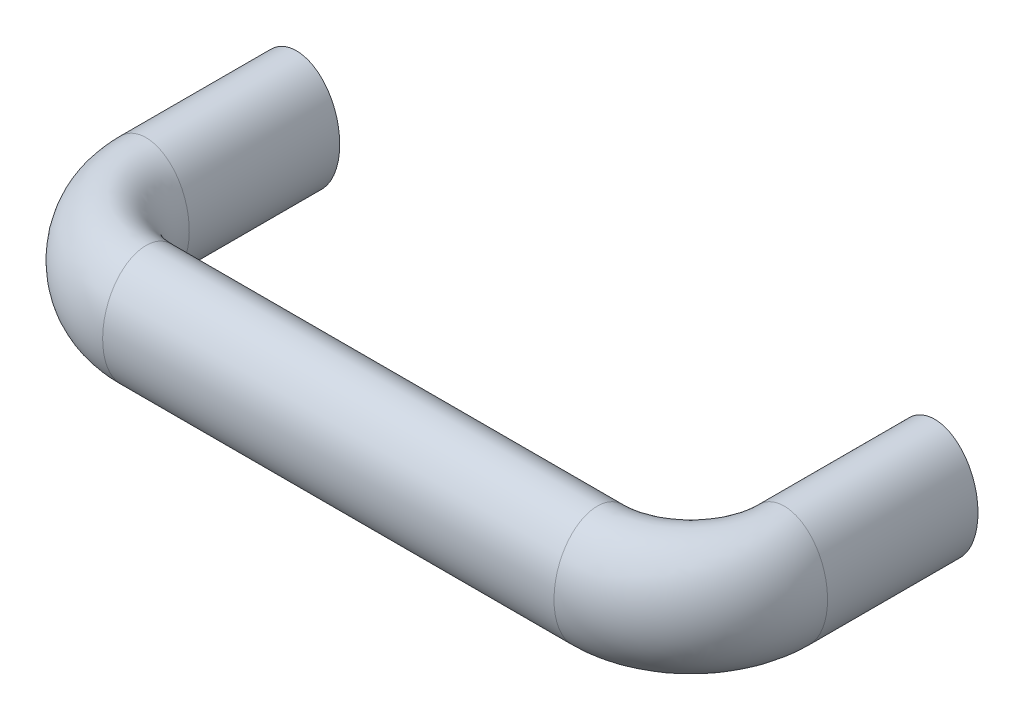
ISO-10303-21;
HEADER;
FILE_DESCRIPTION(('STEP AP214'),'2;1');
FILE_NAME('part.step','',(''),(''),'','','');
FILE_SCHEMA(('AUTOMOTIVE_DESIGN { 1 0 10303 214 1 1 1 1 }'));
ENDSEC;
DATA;
#1=APPLICATION_CONTEXT('core data for automotive mechanical design processes');
#2=APPLICATION_PROTOCOL_DEFINITION('international standard','automotive_design',2000,#1);
#3=PRODUCT_CONTEXT('',#1,'mechanical');
#4=PRODUCT('Part','Part','',(#3));
#5=PRODUCT_RELATED_PRODUCT_CATEGORY('part','',(#4));
#6=PRODUCT_DEFINITION_FORMATION('','',#4);
#7=PRODUCT_DEFINITION_CONTEXT('part definition',#1,'design');
#8=PRODUCT_DEFINITION('design','',#6,#7);
#9=PRODUCT_DEFINITION_SHAPE('','',#8);
#10=(LENGTH_UNIT() NAMED_UNIT(*) SI_UNIT(.MILLI.,.METRE.));
#11=(NAMED_UNIT(*) PLANE_ANGLE_UNIT() SI_UNIT($,.RADIAN.));
#12=(NAMED_UNIT(*) SI_UNIT($,.STERADIAN.) SOLID_ANGLE_UNIT());
#13=UNCERTAINTY_MEASURE_WITH_UNIT(LENGTH_MEASURE(1.E-05),#10,'distance_accuracy_value','');
#14=(GEOMETRIC_REPRESENTATION_CONTEXT(3) GLOBAL_UNCERTAINTY_ASSIGNED_CONTEXT((#13)) GLOBAL_UNIT_ASSIGNED_CONTEXT((#10,
#11,#12)) REPRESENTATION_CONTEXT('',''));
#15=CARTESIAN_POINT('',(0.,0.,0.));
#16=DIRECTION('',(0.,0.,1.));
#17=DIRECTION('',(1.,0.,0.));
#18=AXIS2_PLACEMENT_3D('',#15,#16,#17);
#19=CARTESIAN_POINT('',(0.,0.,0.));
#20=DIRECTION('',(0.,0.,-1.));
#21=DIRECTION('',(0.,1.,0.));
#22=AXIS2_PLACEMENT_3D('',#19,#20,#21);
#23=CONICAL_SURFACE('',#22,3.24999999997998,0.785398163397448);
#24=CARTESIAN_POINT('',(0.,0.,0.249999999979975));
#25=DIRECTION('',(0.,0.,-1.));
#26=DIRECTION('',(0.,1.,0.));
#27=AXIS2_PLACEMENT_3D('',#24,#25,#26);
#28=CIRCLE('',#27,3.);
#29=CARTESIAN_POINT('',(0.,3.,0.249999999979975));
#30=VERTEX_POINT('',#29);
#31=EDGE_CURVE('E15',#30,#30,#28,.F.);
#32=ORIENTED_EDGE('',*,*,#31,.T.);
#33=EDGE_LOOP('',(#32));
#34=FACE_BOUND('',#33,.T.);
#35=CARTESIAN_POINT('',(0.,0.,0.));
#36=DIRECTION('',(0.,0.,-1.));
#37=DIRECTION('',(0.,1.,0.));
#38=AXIS2_PLACEMENT_3D('',#35,#36,#37);
#39=CIRCLE('',#38,3.24999999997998);
#40=CARTESIAN_POINT('',(0.,3.24999999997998,0.));
#41=VERTEX_POINT('',#40);
#42=EDGE_CURVE('E166',#41,#41,#39,.T.);
#43=ORIENTED_EDGE('',*,*,#42,.T.);
#44=EDGE_LOOP('',(#43));
#45=FACE_BOUND('',#44,.T.);
#46=ADVANCED_FACE('F12',(#34,#45),#23,.F.);
#47=CARTESIAN_POINT('',(140.,0.,0.));
#48=DIRECTION('',(0.,0.,-1.));
#49=DIRECTION('',(0.,1.,0.));
#50=AXIS2_PLACEMENT_3D('',#47,#48,#49);
#51=CONICAL_SURFACE('',#50,3.24999999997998,0.785398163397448);
#52=CARTESIAN_POINT('',(140.,0.,0.249999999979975));
#53=DIRECTION('',(0.,0.,-1.));
#54=DIRECTION('',(0.,1.,0.));
#55=AXIS2_PLACEMENT_3D('',#52,#53,#54);
#56=CIRCLE('',#55,3.);
#57=CARTESIAN_POINT('',(140.,3.,0.249999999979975));
#58=VERTEX_POINT('',#57);
#59=EDGE_CURVE('E153',#58,#58,#56,.F.);
#60=ORIENTED_EDGE('',*,*,#59,.T.);
#61=EDGE_LOOP('',(#60));
#62=FACE_BOUND('',#61,.T.);
#63=CARTESIAN_POINT('',(140.,0.,0.));
#64=DIRECTION('',(0.,0.,-1.));
#65=DIRECTION('',(0.,1.,0.));
#66=AXIS2_PLACEMENT_3D('',#63,#64,#65);
#67=CIRCLE('',#66,3.24999999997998);
#68=CARTESIAN_POINT('',(140.,3.24999999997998,0.));
#69=VERTEX_POINT('',#68);
#70=EDGE_CURVE('E165',#69,#69,#67,.T.);
#71=ORIENTED_EDGE('',*,*,#70,.T.);
#72=EDGE_LOOP('',(#71));
#73=FACE_BOUND('',#72,.T.);
#74=ADVANCED_FACE('F160',(#62,#73),#51,.F.);
#75=CARTESIAN_POINT('',(0.,0.,0.));
#76=DIRECTION('',(0.,0.,1.));
#77=DIRECTION('',(0.,-1.,0.));
#78=AXIS2_PLACEMENT_3D('',#75,#76,#77);
#79=PLANE('',#78);
#80=ORIENTED_EDGE('',*,*,#42,.F.);
#81=EDGE_LOOP('',(#80));
#82=FACE_BOUND('',#81,.T.);
#83=CARTESIAN_POINT('',(0.,13.,0.));
#84=CARTESIAN_POINT('',(0.206412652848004,13.00000234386,0.));
#85=CARTESIAN_POINT('',(0.412805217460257,12.9907811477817,0.));
#86=CARTESIAN_POINT('',(0.824029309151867,12.9540720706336,0.));
#87=CARTESIAN_POINT('',(1.02886032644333,12.9265784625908,0.));
#88=CARTESIAN_POINT('',(1.43555302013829,12.8537865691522,0.));
#89=CARTESIAN_POINT('',(1.63741116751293,12.8084686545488,0.));
#90=CARTESIAN_POINT('',(2.03651460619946,12.7008330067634,0.));
#91=CARTESIAN_POINT('',(2.2337601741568,12.6385162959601,0.));
#92=CARTESIAN_POINT('',(2.62135698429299,12.4982959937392,0.));
#93=CARTESIAN_POINT('',(2.81174074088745,12.4204819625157,0.));
#94=CARTESIAN_POINT('',(3.18581142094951,12.2501939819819,0.));
#95=CARTESIAN_POINT('',(3.36949839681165,12.1577201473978,0.));
#96=CARTESIAN_POINT('',(3.72948719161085,11.9592947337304,0.));
#97=CARTESIAN_POINT('',(3.90578704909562,11.8533396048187,0.));
#98=CARTESIAN_POINT('',(4.25043600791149,11.6291813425,0.));
#99=CARTESIAN_POINT('',(4.41878342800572,11.5109756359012,0.));
#100=CARTESIAN_POINT('',(4.81452580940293,11.2127222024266,0.));
#101=CARTESIAN_POINT('',(5.03781150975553,11.0271983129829,0.));
#102=CARTESIAN_POINT('',(5.46726207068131,10.6372637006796,0.));
#103=CARTESIAN_POINT('',(5.67342023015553,10.4328456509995,0.));
#104=CARTESIAN_POINT('',(6.06857016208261,10.0077952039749,0.));
#105=CARTESIAN_POINT('',(6.25754862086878,9.78715046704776,0.));
#106=CARTESIAN_POINT('',(6.6182258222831,9.33231332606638,0.));
#107=CARTESIAN_POINT('',(6.78992836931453,9.09812392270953,0.));
#108=CARTESIAN_POINT('',(7.16996493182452,8.53952051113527,0.));
#109=CARTESIAN_POINT('',(7.37184524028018,8.21070484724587,0.));
#110=CARTESIAN_POINT('',(7.7463786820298,7.5373962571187,0.));
#111=CARTESIAN_POINT('',(7.91906139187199,7.1929196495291,0.));
#112=CARTESIAN_POINT('',(8.23777608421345,6.48832172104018,0.));
#113=CARTESIAN_POINT('',(8.38356591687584,6.12809127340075,0.));
#114=CARTESIAN_POINT('',(8.64758055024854,5.39756045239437,0.));
#115=CARTESIAN_POINT('',(8.76579479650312,5.02725628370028,0.));
#116=CARTESIAN_POINT('',(8.97563893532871,4.27816079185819,0.));
#117=CARTESIAN_POINT('',(9.06719766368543,3.89934960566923,0.));
#118=CARTESIAN_POINT('',(9.22392481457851,3.13636278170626,0.));
#119=CARTESIAN_POINT('',(9.28909481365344,2.75218746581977,0.));
#120=CARTESIAN_POINT('',(9.4016963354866,1.91979323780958,0.));
#121=CARTESIAN_POINT('',(9.44474454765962,1.47097717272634,0.));
#122=CARTESIAN_POINT('',(9.49654995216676,0.571302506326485,0.));
#123=CARTESIAN_POINT('',(9.50530003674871,0.120443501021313,0.));
#124=CARTESIAN_POINT('',(9.48859055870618,-0.779733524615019,0.));
#125=CARTESIAN_POINT('',(9.46320037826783,-1.22905281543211,0.));
#126=CARTESIAN_POINT('',(9.37811026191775,-2.12428059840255,0.));
#127=CARTESIAN_POINT('',(9.3184222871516,-2.57019022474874,0.));
#128=CARTESIAN_POINT('',(9.15762595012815,-3.49369805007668,0.));
#129=CARTESIAN_POINT('',(9.05342462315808,-3.97076316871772,0.));
#130=CARTESIAN_POINT('',(8.80271131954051,-4.91432732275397,0.));
#131=CARTESIAN_POINT('',(8.65615135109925,-5.38081372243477,0.));
#132=CARTESIAN_POINT('',(8.35114160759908,-6.2110148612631,0.));
#133=CARTESIAN_POINT('',(8.20017879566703,-6.57748513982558,0.));
#134=CARTESIAN_POINT('',(7.86845179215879,-7.29692174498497,0.));
#135=CARTESIAN_POINT('',(7.68767700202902,-7.64988321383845,0.));
#136=CARTESIAN_POINT('',(7.2955569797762,-8.33797791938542,0.));
#137=CARTESIAN_POINT('',(7.08424800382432,-8.67313166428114,0.));
#138=CARTESIAN_POINT('',(6.6300976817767,-9.32130455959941,0.));
#139=CARTESIAN_POINT('',(6.38725897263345,-9.63432555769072,0.));
#140=CARTESIAN_POINT('',(5.79569093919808,-10.3176463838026,0.));
#141=CARTESIAN_POINT('',(5.43644082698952,-10.6790959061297,0.));
#142=CARTESIAN_POINT('',(4.85883734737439,-11.1753551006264,0.));
#143=CARTESIAN_POINT('',(4.65988714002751,-11.3330982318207,0.));
#144=CARTESIAN_POINT('',(4.24936863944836,-11.6313213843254,0.));
#145=CARTESIAN_POINT('',(4.03780237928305,-11.771804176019,0.));
#146=CARTESIAN_POINT('',(3.63726963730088,-12.0125453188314,0.));
#147=CARTESIAN_POINT('',(3.45001148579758,-12.1156523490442,0.));
#148=CARTESIAN_POINT('',(3.06788610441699,-12.3066195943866,0.));
#149=CARTESIAN_POINT('',(2.87302035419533,-12.3944827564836,0.));
#150=CARTESIAN_POINT('',(2.47692183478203,-12.5535301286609,0.));
#151=CARTESIAN_POINT('',(2.27569928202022,-12.6247396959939,0.));
#152=CARTESIAN_POINT('',(1.86790164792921,-12.7494388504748,0.));
#153=CARTESIAN_POINT('',(1.6613284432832,-12.8029345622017,0.));
#154=CARTESIAN_POINT('',(1.21417655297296,-12.8976152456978,0.));
#155=CARTESIAN_POINT('',(0.972980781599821,-12.9359223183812,0.));
#156=CARTESIAN_POINT('',(0.487847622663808,-12.9871154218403,0.));
#157=CARTESIAN_POINT('',(0.243909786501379,-12.999997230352,0.));
#158=CARTESIAN_POINT('',(-0.206412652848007,-13.00000234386,0.));
#159=CARTESIAN_POINT('',(-0.412805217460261,-12.9907811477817,0.));
#160=CARTESIAN_POINT('',(-0.824029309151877,-12.9540720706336,0.));
#161=CARTESIAN_POINT('',(-1.02886032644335,-12.9265784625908,0.));
#162=CARTESIAN_POINT('',(-1.43555302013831,-12.8537865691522,0.));
#163=CARTESIAN_POINT('',(-1.63741116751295,-12.8084686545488,0.));
#164=CARTESIAN_POINT('',(-2.03651460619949,-12.7008330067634,0.));
#165=CARTESIAN_POINT('',(-2.23376017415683,-12.6385162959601,0.));
#166=CARTESIAN_POINT('',(-2.62135698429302,-12.4982959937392,0.));
#167=CARTESIAN_POINT('',(-2.81174074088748,-12.4204819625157,0.));
#168=CARTESIAN_POINT('',(-3.18581142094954,-12.2501939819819,0.));
#169=CARTESIAN_POINT('',(-3.36949839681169,-12.1577201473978,0.));
#170=CARTESIAN_POINT('',(-3.72948719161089,-11.9592947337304,0.));
#171=CARTESIAN_POINT('',(-3.90578704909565,-11.8533396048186,0.));
#172=CARTESIAN_POINT('',(-4.25043600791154,-11.6291813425,0.));
#173=CARTESIAN_POINT('',(-4.41878342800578,-11.5109756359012,0.));
#174=CARTESIAN_POINT('',(-4.81452580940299,-11.2127222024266,0.));
#175=CARTESIAN_POINT('',(-5.03781150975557,-11.0271983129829,0.));
#176=CARTESIAN_POINT('',(-5.46726207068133,-10.6372637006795,0.));
#177=CARTESIAN_POINT('',(-5.67342023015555,-10.4328456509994,0.));
#178=CARTESIAN_POINT('',(-6.06857016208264,-10.0077952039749,0.));
#179=CARTESIAN_POINT('',(-6.25754862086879,-9.78715046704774,0.));
#180=CARTESIAN_POINT('',(-6.61822582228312,-9.33231332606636,0.));
#181=CARTESIAN_POINT('',(-6.78992836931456,-9.09812392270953,0.));
#182=CARTESIAN_POINT('',(-7.16996493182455,-8.53952051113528,0.));
#183=CARTESIAN_POINT('',(-7.37184524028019,-8.21070484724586,0.));
#184=CARTESIAN_POINT('',(-7.7463786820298,-7.53739625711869,0.));
#185=CARTESIAN_POINT('',(-7.91906139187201,-7.1929196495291,0.));
#186=CARTESIAN_POINT('',(-8.23777608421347,-6.48832172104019,0.));
#187=CARTESIAN_POINT('',(-8.38356591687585,-6.12809127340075,0.));
#188=CARTESIAN_POINT('',(-8.64758055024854,-5.39756045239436,0.));
#189=CARTESIAN_POINT('',(-8.76579479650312,-5.02725628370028,0.));
#190=CARTESIAN_POINT('',(-8.97563893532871,-4.27816079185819,0.));
#191=CARTESIAN_POINT('',(-9.06719766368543,-3.89934960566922,0.));
#192=CARTESIAN_POINT('',(-9.22392481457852,-3.13636278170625,0.));
#193=CARTESIAN_POINT('',(-9.28909481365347,-2.75218746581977,0.));
#194=CARTESIAN_POINT('',(-9.40169633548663,-1.91979323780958,0.));
#195=CARTESIAN_POINT('',(-9.44474454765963,-1.47097717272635,0.));
#196=CARTESIAN_POINT('',(-9.49654995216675,-0.571302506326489,0.));
#197=CARTESIAN_POINT('',(-9.50530003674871,-0.120443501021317,0.));
#198=CARTESIAN_POINT('',(-9.48859055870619,0.779733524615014,0.));
#199=CARTESIAN_POINT('',(-9.46320037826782,1.22905281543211,0.));
#200=CARTESIAN_POINT('',(-9.37811026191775,2.12428059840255,0.));
#201=CARTESIAN_POINT('',(-9.31842228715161,2.57019022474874,0.));
#202=CARTESIAN_POINT('',(-9.15762595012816,3.49369805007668,0.));
#203=CARTESIAN_POINT('',(-9.05342462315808,3.97076316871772,0.));
#204=CARTESIAN_POINT('',(-8.80271131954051,4.91432732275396,0.));
#205=CARTESIAN_POINT('',(-8.65615135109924,5.38081372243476,0.));
#206=CARTESIAN_POINT('',(-8.35114160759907,6.21101486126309,0.));
#207=CARTESIAN_POINT('',(-8.20017879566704,6.57748513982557,0.));
#208=CARTESIAN_POINT('',(-7.8684517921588,7.29692174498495,0.));
#209=CARTESIAN_POINT('',(-7.68767700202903,7.64988321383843,0.));
#210=CARTESIAN_POINT('',(-7.29555697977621,8.33797791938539,0.));
#211=CARTESIAN_POINT('',(-7.08424800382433,8.67313166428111,0.));
#212=CARTESIAN_POINT('',(-6.63009768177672,9.32130455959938,0.));
#213=CARTESIAN_POINT('',(-6.38725897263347,9.63432555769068,0.));
#214=CARTESIAN_POINT('',(-5.7956909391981,10.3176463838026,0.));
#215=CARTESIAN_POINT('',(-5.43644082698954,10.6790959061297,0.));
#216=CARTESIAN_POINT('',(-4.85883734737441,11.1753551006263,0.));
#217=CARTESIAN_POINT('',(-4.65988714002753,11.3330982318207,0.));
#218=CARTESIAN_POINT('',(-4.24936863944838,11.6313213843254,0.));
#219=CARTESIAN_POINT('',(-4.03780237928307,11.771804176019,0.));
#220=CARTESIAN_POINT('',(-3.6372696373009,12.0125453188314,0.));
#221=CARTESIAN_POINT('',(-3.4500114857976,12.1156523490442,0.));
#222=CARTESIAN_POINT('',(-3.06788610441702,12.3066195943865,0.));
#223=CARTESIAN_POINT('',(-2.87302035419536,12.3944827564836,0.));
#224=CARTESIAN_POINT('',(-2.47692183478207,12.5535301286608,0.));
#225=CARTESIAN_POINT('',(-2.27569928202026,12.6247396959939,0.));
#226=CARTESIAN_POINT('',(-1.86790164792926,12.7494388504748,0.));
#227=CARTESIAN_POINT('',(-1.66132844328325,12.8029345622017,0.));
#228=CARTESIAN_POINT('',(-1.21417655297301,12.8976152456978,0.));
#229=CARTESIAN_POINT('',(-0.972980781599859,12.9359223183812,0.));
#230=CARTESIAN_POINT('',(-0.487847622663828,12.9871154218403,0.));
#231=CARTESIAN_POINT('',(-0.243909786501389,12.999997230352,0.));
#232=CARTESIAN_POINT('',(0.,13.,0.));
#233=B_SPLINE_CURVE_WITH_KNOTS('',3,(#83,#84,#85,#86,#87,#88,#89,#90,#91,#92,#93,#94,#95,#96,
#97,#98,#99,#100,#101,#102,#103,#104,#105,#106,#107,#108,#109,#110,#111,#112,#113,#114,#115,
#116,#117,#118,#119,#120,#121,#122,#123,#124,#125,#126,#127,#128,#129,#130,#131,#132,#133,#134,
#135,#136,#137,#138,#139,#140,#141,#142,#143,#144,#145,#146,#147,#148,#149,#150,#151,#152,#153,
#154,#155,#156,#157,#158,#159,#160,#161,#162,#163,#164,#165,#166,#167,#168,#169,#170,#171,#172,
#173,#174,#175,#176,#177,#178,#179,#180,#181,#182,#183,#184,#185,#186,#187,#188,#189,#190,#191,
#192,#193,#194,#195,#196,#197,#198,#199,#200,#201,#202,#203,#204,#205,#206,#207,#208,#209,#210,
#211,#212,#213,#214,#215,#216,#217,#218,#219,#220,#221,#222,#223,#224,#225,#226,#227,#228,#229,
#230,#231,#232),.UNSPECIFIED.,.T.,.F.,(4,2,2,2,2,2,2,2,2,2,2,2,2,2,2,2,2,2,2,2,2,2,2,2,2,2,2,2,
2,2,2,2,2,2,2,2,2,2,2,2,2,2,2,2,2,2,2,2,2,2,2,2,2,2,2,2,2,2,2,2,2,2,2,2,2,2,2,2,2,2,2,2,2,2,4),
(0.,0.61899933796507,1.23819277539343,1.85807002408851,2.47790999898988,3.09426671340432,
3.71061860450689,4.32713312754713,4.9437774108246,5.81339838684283,6.68335801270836,
7.55398617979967,8.42442220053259,9.5803197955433,10.7350393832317,11.8996966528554,
13.0647989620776,14.2329838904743,15.4010990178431,16.7523633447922,18.1039076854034,
19.4527094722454,20.8010411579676,22.2641309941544,23.7288850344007,24.9167021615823,
26.1049424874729,27.2917833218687,28.4785249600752,30.0010221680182,30.7619988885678,
31.522853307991,32.1635347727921,32.8040922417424,33.4436679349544,34.0830222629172,
34.8143482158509,35.5457956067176,36.1647949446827,36.783988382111,37.4038656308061,
38.0237056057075,38.640062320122,39.2564142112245,39.8729287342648,40.4895730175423,
41.3591939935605,42.229153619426,43.0997817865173,43.9702178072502,45.1261154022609,
46.2808349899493,47.445492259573,48.6105945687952,49.7787794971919,50.9468946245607,
52.2981589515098,53.649703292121,54.998505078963,56.3468367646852,57.809926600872,
59.2746806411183,60.4624977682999,61.6507380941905,62.8375789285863,64.0243205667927,
65.5468177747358,66.3077944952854,67.0686489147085,67.7093303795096,68.3498878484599,
68.989463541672,69.6288178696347,70.3601438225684,71.0915912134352),.UNSPECIFIED.);
#234=CARTESIAN_POINT('',(0.,13.,0.));
#235=VERTEX_POINT('',#234);
#236=EDGE_CURVE('E65',#235,#235,#233,.T.);
#237=ORIENTED_EDGE('',*,*,#236,.T.);
#238=EDGE_LOOP('',(#237));
#239=FACE_BOUND('',#238,.T.);
#240=ADVANCED_FACE('F105',(#82,#239),#79,.F.);
#241=CARTESIAN_POINT('',(140.,0.,0.));
#242=DIRECTION('',(0.,0.,1.));
#243=DIRECTION('',(0.,-1.,0.));
#244=AXIS2_PLACEMENT_3D('',#241,#242,#243);
#245=PLANE('',#244);
#246=ORIENTED_EDGE('',*,*,#70,.F.);
#247=EDGE_LOOP('',(#246));
#248=FACE_BOUND('',#247,.T.);
#249=CARTESIAN_POINT('',(140.,13.,0.));
#250=CARTESIAN_POINT('',(139.793587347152,13.00000234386,0.));
#251=CARTESIAN_POINT('',(139.58719478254,12.9907811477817,0.));
#252=CARTESIAN_POINT('',(139.175970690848,12.9540720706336,0.));
#253=CARTESIAN_POINT('',(138.971139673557,12.9265784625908,0.));
#254=CARTESIAN_POINT('',(138.564446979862,12.8537865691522,0.));
#255=CARTESIAN_POINT('',(138.362588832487,12.8084686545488,0.));
#256=CARTESIAN_POINT('',(137.963485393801,12.7008330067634,0.));
#257=CARTESIAN_POINT('',(137.766239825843,12.6385162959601,0.));
#258=CARTESIAN_POINT('',(137.378643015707,12.4982959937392,0.));
#259=CARTESIAN_POINT('',(137.188259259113,12.4204819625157,0.));
#260=CARTESIAN_POINT('',(136.81418857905,12.2501939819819,0.));
#261=CARTESIAN_POINT('',(136.630501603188,12.1577201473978,0.));
#262=CARTESIAN_POINT('',(136.270512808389,11.9592947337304,0.));
#263=CARTESIAN_POINT('',(136.094212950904,11.8533396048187,0.));
#264=CARTESIAN_POINT('',(135.749563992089,11.6291813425,0.));
#265=CARTESIAN_POINT('',(135.581216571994,11.5109756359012,0.));
#266=CARTESIAN_POINT('',(135.185474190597,11.2127222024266,0.));
#267=CARTESIAN_POINT('',(134.962188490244,11.0271983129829,0.));
#268=CARTESIAN_POINT('',(134.532737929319,10.6372637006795,0.));
#269=CARTESIAN_POINT('',(134.326579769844,10.4328456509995,0.));
#270=CARTESIAN_POINT('',(133.931429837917,10.0077952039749,0.));
#271=CARTESIAN_POINT('',(133.742451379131,9.78715046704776,0.));
#272=CARTESIAN_POINT('',(133.381774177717,9.33231332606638,0.));
#273=CARTESIAN_POINT('',(133.210071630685,9.09812392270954,0.));
#274=CARTESIAN_POINT('',(132.830035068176,8.53952051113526,0.));
#275=CARTESIAN_POINT('',(132.62815475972,8.21070484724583,0.));
#276=CARTESIAN_POINT('',(132.25362131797,7.53739625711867,0.));
#277=CARTESIAN_POINT('',(132.080938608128,7.1929196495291,0.));
#278=CARTESIAN_POINT('',(131.762223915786,6.4883217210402,0.));
#279=CARTESIAN_POINT('',(131.616434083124,6.12809127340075,0.));
#280=CARTESIAN_POINT('',(131.352419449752,5.39756045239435,0.));
#281=CARTESIAN_POINT('',(131.234205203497,5.02725628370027,0.));
#282=CARTESIAN_POINT('',(131.024361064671,4.27816079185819,0.));
#283=CARTESIAN_POINT('',(130.932802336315,3.89934960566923,0.));
#284=CARTESIAN_POINT('',(130.776075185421,3.13636278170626,0.));
#285=CARTESIAN_POINT('',(130.710905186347,2.75218746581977,0.));
#286=CARTESIAN_POINT('',(130.598303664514,1.91979323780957,0.));
#287=CARTESIAN_POINT('',(130.55525545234,1.47097717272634,0.));
#288=CARTESIAN_POINT('',(130.503450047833,0.571302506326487,0.));
#289=CARTESIAN_POINT('',(130.494699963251,0.120443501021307,0.));
#290=CARTESIAN_POINT('',(130.511409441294,-0.779733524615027,0.));
#291=CARTESIAN_POINT('',(130.536799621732,-1.22905281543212,0.));
#292=CARTESIAN_POINT('',(130.621889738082,-2.12428059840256,0.));
#293=CARTESIAN_POINT('',(130.681577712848,-2.57019022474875,0.));
#294=CARTESIAN_POINT('',(130.842374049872,-3.49369805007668,0.));
#295=CARTESIAN_POINT('',(130.946575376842,-3.9707631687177,0.));
#296=CARTESIAN_POINT('',(131.19728868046,-4.91432732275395,0.));
#297=CARTESIAN_POINT('',(131.343848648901,-5.38081372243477,0.));
#298=CARTESIAN_POINT('',(131.648858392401,-6.2110148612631,0.));
#299=CARTESIAN_POINT('',(131.799821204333,-6.57748513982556,0.));
#300=CARTESIAN_POINT('',(132.131548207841,-7.29692174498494,0.));
#301=CARTESIAN_POINT('',(132.312322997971,-7.64988321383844,0.));
#302=CARTESIAN_POINT('',(132.704443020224,-8.33797791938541,0.));
#303=CARTESIAN_POINT('',(132.915751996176,-8.67313166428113,0.));
#304=CARTESIAN_POINT('',(133.369902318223,-9.3213045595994,0.));
#305=CARTESIAN_POINT('',(133.612741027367,-9.63432555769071,0.));
#306=CARTESIAN_POINT('',(134.204309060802,-10.3176463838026,0.));
#307=CARTESIAN_POINT('',(134.56355917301,-10.6790959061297,0.));
#308=CARTESIAN_POINT('',(135.141162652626,-11.1753551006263,0.));
#309=CARTESIAN_POINT('',(135.340112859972,-11.3330982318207,0.));
#310=CARTESIAN_POINT('',(135.750631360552,-11.6313213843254,0.));
#311=CARTESIAN_POINT('',(135.962197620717,-11.771804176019,0.));
#312=CARTESIAN_POINT('',(136.362730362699,-12.0125453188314,0.));
#313=CARTESIAN_POINT('',(136.549988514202,-12.1156523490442,0.));
#314=CARTESIAN_POINT('',(136.932113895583,-12.3066195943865,0.));
#315=CARTESIAN_POINT('',(137.126979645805,-12.3944827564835,0.));
#316=CARTESIAN_POINT('',(137.523078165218,-12.5535301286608,0.));
#317=CARTESIAN_POINT('',(137.72430071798,-12.6247396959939,0.));
#318=CARTESIAN_POINT('',(138.132098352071,-12.7494388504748,0.));
#319=CARTESIAN_POINT('',(138.338671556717,-12.8029345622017,0.));
#320=CARTESIAN_POINT('',(138.785823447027,-12.8976152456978,0.));
#321=CARTESIAN_POINT('',(139.0270192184,-12.9359223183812,0.));
#322=CARTESIAN_POINT('',(139.512152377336,-12.9871154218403,0.));
#323=CARTESIAN_POINT('',(139.756090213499,-12.999997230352,0.));
#324=CARTESIAN_POINT('',(140.206412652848,-13.00000234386,0.));
#325=CARTESIAN_POINT('',(140.41280521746,-12.9907811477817,0.));
#326=CARTESIAN_POINT('',(140.824029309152,-12.9540720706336,0.));
#327=CARTESIAN_POINT('',(141.028860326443,-12.9265784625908,0.));
#328=CARTESIAN_POINT('',(141.435553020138,-12.8537865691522,0.));
#329=CARTESIAN_POINT('',(141.637411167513,-12.8084686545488,0.));
#330=CARTESIAN_POINT('',(142.036514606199,-12.7008330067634,0.));
#331=CARTESIAN_POINT('',(142.233760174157,-12.6385162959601,0.));
#332=CARTESIAN_POINT('',(142.621356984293,-12.4982959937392,0.));
#333=CARTESIAN_POINT('',(142.811740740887,-12.4204819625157,0.));
#334=CARTESIAN_POINT('',(143.18581142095,-12.2501939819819,0.));
#335=CARTESIAN_POINT('',(143.369498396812,-12.1577201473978,0.));
#336=CARTESIAN_POINT('',(143.729487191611,-11.9592947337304,0.));
#337=CARTESIAN_POINT('',(143.905787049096,-11.8533396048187,0.));
#338=CARTESIAN_POINT('',(144.250436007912,-11.6291813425,0.));
#339=CARTESIAN_POINT('',(144.418783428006,-11.5109756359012,0.));
#340=CARTESIAN_POINT('',(144.814525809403,-11.2127222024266,0.));
#341=CARTESIAN_POINT('',(145.037811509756,-11.0271983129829,0.));
#342=CARTESIAN_POINT('',(145.467262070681,-10.6372637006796,0.));
#343=CARTESIAN_POINT('',(145.673420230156,-10.4328456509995,0.));
#344=CARTESIAN_POINT('',(146.068570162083,-10.007795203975,0.));
#345=CARTESIAN_POINT('',(146.257548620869,-9.7871504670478,0.));
#346=CARTESIAN_POINT('',(146.618225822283,-9.3323133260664,0.));
#347=CARTESIAN_POINT('',(146.789928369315,-9.09812392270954,0.));
#348=CARTESIAN_POINT('',(147.169964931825,-8.53952051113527,0.));
#349=CARTESIAN_POINT('',(147.37184524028,-8.21070484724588,0.));
#350=CARTESIAN_POINT('',(147.74637868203,-7.53739625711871,0.));
#351=CARTESIAN_POINT('',(147.919061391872,-7.19291964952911,0.));
#352=CARTESIAN_POINT('',(148.237776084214,-6.48832172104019,0.));
#353=CARTESIAN_POINT('',(148.383565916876,-6.12809127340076,0.));
#354=CARTESIAN_POINT('',(148.647580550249,-5.39756045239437,0.));
#355=CARTESIAN_POINT('',(148.765794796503,-5.02725628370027,0.));
#356=CARTESIAN_POINT('',(148.975638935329,-4.27816079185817,0.));
#357=CARTESIAN_POINT('',(149.067197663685,-3.89934960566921,0.));
#358=CARTESIAN_POINT('',(149.223924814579,-3.13636278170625,0.));
#359=CARTESIAN_POINT('',(149.289094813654,-2.75218746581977,0.));
#360=CARTESIAN_POINT('',(149.401696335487,-1.91979323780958,0.));
#361=CARTESIAN_POINT('',(149.44474454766,-1.47097717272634,0.));
#362=CARTESIAN_POINT('',(149.496549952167,-0.571302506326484,0.));
#363=CARTESIAN_POINT('',(149.505300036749,-0.120443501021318,0.));
#364=CARTESIAN_POINT('',(149.488590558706,0.779733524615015,0.));
#365=CARTESIAN_POINT('',(149.463200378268,1.22905281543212,0.));
#366=CARTESIAN_POINT('',(149.378110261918,2.12428059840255,0.));
#367=CARTESIAN_POINT('',(149.318422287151,2.57019022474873,0.));
#368=CARTESIAN_POINT('',(149.157625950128,3.49369805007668,0.));
#369=CARTESIAN_POINT('',(149.053424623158,3.97076316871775,0.));
#370=CARTESIAN_POINT('',(148.802711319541,4.914327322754,0.));
#371=CARTESIAN_POINT('',(148.656151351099,5.38081372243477,0.));
#372=CARTESIAN_POINT('',(148.351141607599,6.2110148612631,0.));
#373=CARTESIAN_POINT('',(148.200178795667,6.57748513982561,0.));
#374=CARTESIAN_POINT('',(147.868451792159,7.296921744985,0.));
#375=CARTESIAN_POINT('',(147.687677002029,7.64988321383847,0.));
#376=CARTESIAN_POINT('',(147.295556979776,8.33797791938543,0.));
#377=CARTESIAN_POINT('',(147.084248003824,8.67313166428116,0.));
#378=CARTESIAN_POINT('',(146.630097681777,9.32130455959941,0.));
#379=CARTESIAN_POINT('',(146.387258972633,9.63432555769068,0.));
#380=CARTESIAN_POINT('',(145.795690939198,10.3176463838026,0.));
#381=CARTESIAN_POINT('',(145.436440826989,10.6790959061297,0.));
#382=CARTESIAN_POINT('',(144.858837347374,11.1753551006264,0.));
#383=CARTESIAN_POINT('',(144.659887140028,11.3330982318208,0.));
#384=CARTESIAN_POINT('',(144.249368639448,11.6313213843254,0.));
#385=CARTESIAN_POINT('',(144.037802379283,11.771804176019,0.));
#386=CARTESIAN_POINT('',(143.637269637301,12.0125453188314,0.));
#387=CARTESIAN_POINT('',(143.450011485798,12.1156523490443,0.));
#388=CARTESIAN_POINT('',(143.067886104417,12.3066195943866,0.));
#389=CARTESIAN_POINT('',(142.873020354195,12.3944827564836,0.));
#390=CARTESIAN_POINT('',(142.476921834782,12.5535301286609,0.));
#391=CARTESIAN_POINT('',(142.27569928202,12.624739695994,0.));
#392=CARTESIAN_POINT('',(141.867901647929,12.7494388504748,0.));
#393=CARTESIAN_POINT('',(141.661328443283,12.8029345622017,0.));
#394=CARTESIAN_POINT('',(141.214176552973,12.8976152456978,0.));
#395=CARTESIAN_POINT('',(140.9729807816,12.9359223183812,0.));
#396=CARTESIAN_POINT('',(140.487847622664,12.9871154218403,0.));
#397=CARTESIAN_POINT('',(140.243909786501,12.999997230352,0.));
#398=CARTESIAN_POINT('',(140.,13.,0.));
#399=B_SPLINE_CURVE_WITH_KNOTS('',3,(#249,#250,#251,#252,#253,#254,#255,#256,#257,#258,#259,
#260,#261,#262,#263,#264,#265,#266,#267,#268,#269,#270,#271,#272,#273,#274,#275,#276,#277,#278,
#279,#280,#281,#282,#283,#284,#285,#286,#287,#288,#289,#290,#291,#292,#293,#294,#295,#296,#297,
#298,#299,#300,#301,#302,#303,#304,#305,#306,#307,#308,#309,#310,#311,#312,#313,#314,#315,#316,
#317,#318,#319,#320,#321,#322,#323,#324,#325,#326,#327,#328,#329,#330,#331,#332,#333,#334,#335,
#336,#337,#338,#339,#340,#341,#342,#343,#344,#345,#346,#347,#348,#349,#350,#351,#352,#353,#354,
#355,#356,#357,#358,#359,#360,#361,#362,#363,#364,#365,#366,#367,#368,#369,#370,#371,#372,#373,
#374,#375,#376,#377,#378,#379,#380,#381,#382,#383,#384,#385,#386,#387,#388,#389,#390,#391,#392,
#393,#394,#395,#396,#397,#398),.UNSPECIFIED.,.T.,.F.,(4,2,2,2,2,2,2,2,2,2,2,2,2,2,2,2,2,2,2,2,2,
2,2,2,2,2,2,2,2,2,2,2,2,2,2,2,2,2,2,2,2,2,2,2,2,2,2,2,2,2,2,2,2,2,2,2,2,2,2,2,2,2,2,2,2,2,2,2,2,
2,2,2,2,2,4),(0.,0.618999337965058,1.23819277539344,1.85807002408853,2.47790999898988,
3.09426671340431,3.7106186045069,4.32713312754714,4.94377741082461,5.81339838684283,
6.68335801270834,7.55398617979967,8.42442220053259,9.58031979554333,10.7350393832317,
11.8996966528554,13.0647989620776,14.2329838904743,15.4010990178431,16.7523633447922,
18.1039076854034,19.4527094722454,20.8010411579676,22.2641309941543,23.7288850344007,
24.9167021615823,26.1049424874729,27.2917833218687,28.4785249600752,30.0010221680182,
30.7619988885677,31.5228533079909,32.163534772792,32.8040922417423,33.4436679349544,
34.0830222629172,34.8143482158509,35.5457956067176,36.1647949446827,36.783988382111,
37.4038656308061,38.0237056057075,38.6400623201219,39.2564142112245,39.8729287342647,
40.4895730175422,41.3591939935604,42.229153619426,43.0997817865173,43.9702178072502,
45.1261154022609,46.2808349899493,47.4454922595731,48.6105945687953,49.7787794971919,
50.9468946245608,52.2981589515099,53.6497032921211,54.9985050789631,56.3468367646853,
57.8099266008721,59.2746806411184,60.4624977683,61.6507380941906,62.8375789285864,
64.0243205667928,65.546817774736,66.3077944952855,67.0686489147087,67.7093303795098,
68.3498878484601,68.9894635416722,69.6288178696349,70.3601438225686,71.0915912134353),.UNSPECIFIED.);
#400=CARTESIAN_POINT('',(140.,13.,0.));
#401=VERTEX_POINT('',#400);
#402=EDGE_CURVE('E50',#401,#401,#399,.T.);
#403=ORIENTED_EDGE('',*,*,#402,.F.);
#404=EDGE_LOOP('',(#403));
#405=FACE_BOUND('',#404,.T.);
#406=ADVANCED_FACE('F72',(#248,#405),#245,.F.);
#407=CARTESIAN_POINT('',(0.,-13.,33.));
#408=CARTESIAN_POINT('',(0.,-13.,0.));
#409=CARTESIAN_POINT('',(19.,-13.,33.));
#410=CARTESIAN_POINT('',(19.,-13.,0.));
#411=CARTESIAN_POINT('',(19.,13.,33.));
#412=CARTESIAN_POINT('',(19.,13.,0.));
#413=CARTESIAN_POINT('',(0.,13.,33.));
#414=CARTESIAN_POINT('',(0.,13.,0.));
#415=CARTESIAN_POINT('',(-19.,13.,33.));
#416=CARTESIAN_POINT('',(-19.,13.,0.));
#417=CARTESIAN_POINT('',(-19.,-13.,33.));
#418=CARTESIAN_POINT('',(-19.,-13.,0.));
#419=CARTESIAN_POINT('',(0.,-13.,33.));
#420=CARTESIAN_POINT('',(0.,-13.,0.));
#421=(BOUNDED_SURFACE() B_SPLINE_SURFACE(3,1,((#407,#408),(#409,#410),(#411,#412),(#413,#414),
(#415,#416),(#417,#418),(#419,#420)),.UNSPECIFIED.,.T.,.F.,.F.) B_SPLINE_SURFACE_WITH_KNOTS((4,
3,4),(2,2),(0.,0.5,1.),(0.,1.),
.UNSPECIFIED.) GEOMETRIC_REPRESENTATION_ITEM() RATIONAL_B_SPLINE_SURFACE(((1.,1.),
(0.333333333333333,0.333333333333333),(0.333333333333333,0.333333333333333),(1.,1.),
(0.333333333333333,0.333333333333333),(0.333333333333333,0.333333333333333),(1.,1.))) REPRESENTATION_ITEM('') SURFACE());
#422=CARTESIAN_POINT('',(0.,-13.,33.));
#423=CARTESIAN_POINT('',(19.,-13.,33.));
#424=CARTESIAN_POINT('',(19.,13.,33.));
#425=CARTESIAN_POINT('',(0.,13.,33.));
#426=CARTESIAN_POINT('',(-19.,13.,33.));
#427=CARTESIAN_POINT('',(-19.,-13.,33.));
#428=CARTESIAN_POINT('',(0.,-13.,33.));
#429=(BOUNDED_CURVE() B_SPLINE_CURVE(3,(#422,#423,#424,#425,#426,#427,#428),.UNSPECIFIED.,.T.,
.F.) B_SPLINE_CURVE_WITH_KNOTS((4,3,4),(0.,0.5,1.),
.UNSPECIFIED.) CURVE() GEOMETRIC_REPRESENTATION_ITEM() RATIONAL_B_SPLINE_CURVE((1.,
0.333333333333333,0.333333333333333,1.,0.333333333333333,0.333333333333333,1.)) REPRESENTATION_ITEM(''));
#430=CARTESIAN_POINT('',(0.,-13.,33.));
#431=VERTEX_POINT('',#430);
#432=EDGE_CURVE('E44',#431,#431,#429,.T.);
#433=ORIENTED_EDGE('',*,*,#236,.F.);
#434=EDGE_LOOP('',(#433));
#435=FACE_BOUND('',#434,.T.);
#436=ORIENTED_EDGE('',*,*,#432,.F.);
#437=EDGE_LOOP('',(#436));
#438=FACE_BOUND('',#437,.T.);
#439=ADVANCED_FACE('F81',(#435,#438),#421,.F.);
#440=CARTESIAN_POINT('',(140.,-13.,33.));
#441=CARTESIAN_POINT('',(140.,-13.,0.));
#442=CARTESIAN_POINT('',(121.,-13.,33.));
#443=CARTESIAN_POINT('',(121.,-13.,0.));
#444=CARTESIAN_POINT('',(121.,13.,33.));
#445=CARTESIAN_POINT('',(121.,13.,0.));
#446=CARTESIAN_POINT('',(140.,13.,33.));
#447=CARTESIAN_POINT('',(140.,13.,0.));
#448=CARTESIAN_POINT('',(159.,13.,33.));
#449=CARTESIAN_POINT('',(159.,13.,0.));
#450=CARTESIAN_POINT('',(159.,-13.,33.));
#451=CARTESIAN_POINT('',(159.,-13.,0.));
#452=CARTESIAN_POINT('',(140.,-13.,33.));
#453=CARTESIAN_POINT('',(140.,-13.,0.));
#454=(BOUNDED_SURFACE() B_SPLINE_SURFACE(3,1,((#440,#441),(#442,#443),(#444,#445),(#446,#447),
(#448,#449),(#450,#451),(#452,#453)),.UNSPECIFIED.,.T.,.F.,.F.) B_SPLINE_SURFACE_WITH_KNOTS((4,
3,4),(2,2),(0.,0.5,1.),(0.,1.),
.UNSPECIFIED.) GEOMETRIC_REPRESENTATION_ITEM() RATIONAL_B_SPLINE_SURFACE(((1.,1.),
(0.333333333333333,0.333333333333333),(0.333333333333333,0.333333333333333),(1.,1.),
(0.333333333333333,0.333333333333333),(0.333333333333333,0.333333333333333),(1.,1.))) REPRESENTATION_ITEM('') SURFACE());
#455=CARTESIAN_POINT('',(140.,-13.,33.));
#456=CARTESIAN_POINT('',(121.,-13.,33.));
#457=CARTESIAN_POINT('',(121.,13.,33.));
#458=CARTESIAN_POINT('',(140.,13.,33.));
#459=CARTESIAN_POINT('',(159.,13.,33.));
#460=CARTESIAN_POINT('',(159.,-13.,33.));
#461=CARTESIAN_POINT('',(140.,-13.,33.));
#462=(BOUNDED_CURVE() B_SPLINE_CURVE(3,(#455,#456,#457,#458,#459,#460,#461),.UNSPECIFIED.,.T.,
.F.) B_SPLINE_CURVE_WITH_KNOTS((4,3,4),(0.,0.5,1.),
.UNSPECIFIED.) CURVE() GEOMETRIC_REPRESENTATION_ITEM() RATIONAL_B_SPLINE_CURVE((1.,
0.333333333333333,0.333333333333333,1.,0.333333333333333,0.333333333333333,1.)) REPRESENTATION_ITEM(''));
#463=CARTESIAN_POINT('',(140.,-13.,33.));
#464=VERTEX_POINT('',#463);
#465=EDGE_CURVE('E24',#464,#464,#462,.T.);
#466=ORIENTED_EDGE('',*,*,#465,.T.);
#467=EDGE_LOOP('',(#466));
#468=FACE_BOUND('',#467,.T.);
#469=ORIENTED_EDGE('',*,*,#402,.T.);
#470=EDGE_LOOP('',(#469));
#471=FACE_BOUND('',#470,.T.);
#472=ADVANCED_FACE('F74',(#468,#471),#454,.T.);
#473=CARTESIAN_POINT('',(0.,-13.,33.));
#474=CARTESIAN_POINT('',(0.,-13.,45.0086219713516));
#475=CARTESIAN_POINT('',(8.49137802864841,-13.,53.5));
#476=CARTESIAN_POINT('',(20.5,-13.,53.5));
#477=CARTESIAN_POINT('',(19.,-13.,33.));
#478=CARTESIAN_POINT('',(19.,-13.,33.8786796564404));
#479=CARTESIAN_POINT('',(19.6213203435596,-13.,34.5));
#480=CARTESIAN_POINT('',(20.5,-13.,34.5));
#481=CARTESIAN_POINT('',(19.,13.,33.));
#482=CARTESIAN_POINT('',(19.,13.,33.8786796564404));
#483=CARTESIAN_POINT('',(19.6213203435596,13.,34.5));
#484=CARTESIAN_POINT('',(20.5,13.,34.5));
#485=CARTESIAN_POINT('',(0.,13.,33.));
#486=CARTESIAN_POINT('',(0.,13.,45.0086219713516));
#487=CARTESIAN_POINT('',(8.49137802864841,13.,53.5));
#488=CARTESIAN_POINT('',(20.5,13.,53.5));
#489=CARTESIAN_POINT('',(-19.,13.,33.));
#490=CARTESIAN_POINT('',(-19.,13.,56.1385642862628));
#491=CARTESIAN_POINT('',(-2.6385642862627,13.,72.5000000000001));
#492=CARTESIAN_POINT('',(20.5,13.,72.5));
#493=CARTESIAN_POINT('',(-19.,-13.,33.));
#494=CARTESIAN_POINT('',(-19.,-13.,56.1385642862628));
#495=CARTESIAN_POINT('',(-2.6385642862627,-13.,72.5000000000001));
#496=CARTESIAN_POINT('',(20.5,-13.,72.5));
#497=CARTESIAN_POINT('',(0.,-13.,33.));
#498=CARTESIAN_POINT('',(0.,-13.,45.0086219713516));
#499=CARTESIAN_POINT('',(8.49137802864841,-13.,53.5));
#500=CARTESIAN_POINT('',(20.5,-13.,53.5));
#501=(BOUNDED_SURFACE() B_SPLINE_SURFACE(3,3,((#473,#474,#475,#476),(#477,#478,#479,#480),(#481,
#482,#483,#484),(#485,#486,#487,#488),(#489,#490,#491,#492),(#493,#494,#495,#496),(#497,#498,
#499,#500)),.UNSPECIFIED.,.T.,.F.,.F.) B_SPLINE_SURFACE_WITH_KNOTS((4,3,4),(4,4),(0.,0.5,1.),
(0.,1.),.UNSPECIFIED.) GEOMETRIC_REPRESENTATION_ITEM() RATIONAL_B_SPLINE_SURFACE(((1.,
0.804737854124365,0.804737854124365,1.),(0.333333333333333,0.268245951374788,0.268245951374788,
0.333333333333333),(0.333333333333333,0.268245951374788,0.268245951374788,0.333333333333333),
(1.,0.804737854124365,0.804737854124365,1.),(0.333333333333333,0.268245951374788,
0.268245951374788,0.333333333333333),(0.333333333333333,0.268245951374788,0.268245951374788,
0.333333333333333),(1.,0.804737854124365,0.804737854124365,1.))) REPRESENTATION_ITEM('') SURFACE());
#502=CARTESIAN_POINT('',(20.5,-13.,53.5));
#503=CARTESIAN_POINT('',(20.5,-13.,34.5));
#504=CARTESIAN_POINT('',(20.5,13.,34.5));
#505=CARTESIAN_POINT('',(20.5,13.,53.5));
#506=CARTESIAN_POINT('',(20.5,13.,72.5));
#507=CARTESIAN_POINT('',(20.5,-13.,72.5));
#508=CARTESIAN_POINT('',(20.5,-13.,53.5));
#509=(BOUNDED_CURVE() B_SPLINE_CURVE(3,(#502,#503,#504,#505,#506,#507,#508),.UNSPECIFIED.,.T.,
.F.) B_SPLINE_CURVE_WITH_KNOTS((4,3,4),(0.,0.5,1.),
.UNSPECIFIED.) CURVE() GEOMETRIC_REPRESENTATION_ITEM() RATIONAL_B_SPLINE_CURVE((1.,
0.333333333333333,0.333333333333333,1.,0.333333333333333,0.333333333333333,1.)) REPRESENTATION_ITEM(''));
#510=CARTESIAN_POINT('',(20.5,-13.,53.5));
#511=VERTEX_POINT('',#510);
#512=EDGE_CURVE('E19',#511,#511,#509,.T.);
#513=ORIENTED_EDGE('',*,*,#432,.T.);
#514=EDGE_LOOP('',(#513));
#515=FACE_BOUND('',#514,.T.);
#516=ORIENTED_EDGE('',*,*,#512,.F.);
#517=EDGE_LOOP('',(#516));
#518=FACE_BOUND('',#517,.T.);
#519=ADVANCED_FACE('F80',(#515,#518),#501,.T.);
#520=CARTESIAN_POINT('',(140.,-13.,33.));
#521=CARTESIAN_POINT('',(140.,-13.,45.0086219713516));
#522=CARTESIAN_POINT('',(131.508621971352,-13.,53.5));
#523=CARTESIAN_POINT('',(119.5,-13.,53.5));
#524=CARTESIAN_POINT('',(121.,-13.,33.));
#525=CARTESIAN_POINT('',(121.,-13.,33.8786796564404));
#526=CARTESIAN_POINT('',(120.37867965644,-13.,34.5));
#527=CARTESIAN_POINT('',(119.5,-13.,34.5));
#528=CARTESIAN_POINT('',(121.,13.,33.));
#529=CARTESIAN_POINT('',(121.,13.,33.8786796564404));
#530=CARTESIAN_POINT('',(120.37867965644,13.,34.5));
#531=CARTESIAN_POINT('',(119.5,13.,34.5));
#532=CARTESIAN_POINT('',(140.,13.,33.));
#533=CARTESIAN_POINT('',(140.,13.,45.0086219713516));
#534=CARTESIAN_POINT('',(131.508621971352,13.,53.5));
#535=CARTESIAN_POINT('',(119.5,13.,53.5));
#536=CARTESIAN_POINT('',(159.,13.,33.));
#537=CARTESIAN_POINT('',(159.,13.,56.1385642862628));
#538=CARTESIAN_POINT('',(142.638564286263,13.,72.5000000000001));
#539=CARTESIAN_POINT('',(119.5,13.,72.5));
#540=CARTESIAN_POINT('',(159.,-13.,33.));
#541=CARTESIAN_POINT('',(159.,-13.,56.1385642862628));
#542=CARTESIAN_POINT('',(142.638564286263,-13.,72.5000000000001));
#543=CARTESIAN_POINT('',(119.5,-13.,72.5));
#544=CARTESIAN_POINT('',(140.,-13.,33.));
#545=CARTESIAN_POINT('',(140.,-13.,45.0086219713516));
#546=CARTESIAN_POINT('',(131.508621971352,-13.,53.5));
#547=CARTESIAN_POINT('',(119.5,-13.,53.5));
#548=(BOUNDED_SURFACE() B_SPLINE_SURFACE(3,3,((#520,#521,#522,#523),(#524,#525,#526,#527),(#528,
#529,#530,#531),(#532,#533,#534,#535),(#536,#537,#538,#539),(#540,#541,#542,#543),(#544,#545,
#546,#547)),.UNSPECIFIED.,.T.,.F.,.F.) B_SPLINE_SURFACE_WITH_KNOTS((4,3,4),(4,4),(0.,0.5,1.),
(0.,1.),.UNSPECIFIED.) GEOMETRIC_REPRESENTATION_ITEM() RATIONAL_B_SPLINE_SURFACE(((1.,
0.804737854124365,0.804737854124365,1.),(0.333333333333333,0.268245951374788,0.268245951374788,
0.333333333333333),(0.333333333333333,0.268245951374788,0.268245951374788,0.333333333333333),
(1.,0.804737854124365,0.804737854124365,1.),(0.333333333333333,0.268245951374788,
0.268245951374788,0.333333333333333),(0.333333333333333,0.268245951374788,0.268245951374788,
0.333333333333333),(1.,0.804737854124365,0.804737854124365,1.))) REPRESENTATION_ITEM('') SURFACE());
#549=CARTESIAN_POINT('',(119.5,-13.,53.5));
#550=CARTESIAN_POINT('',(119.5,-13.,34.5));
#551=CARTESIAN_POINT('',(119.5,13.,34.5));
#552=CARTESIAN_POINT('',(119.5,13.,53.5));
#553=CARTESIAN_POINT('',(119.5,13.,72.5));
#554=CARTESIAN_POINT('',(119.5,-13.,72.5));
#555=CARTESIAN_POINT('',(119.5,-13.,53.5));
#556=(BOUNDED_CURVE() B_SPLINE_CURVE(3,(#549,#550,#551,#552,#553,#554,#555),.UNSPECIFIED.,.T.,
.F.) B_SPLINE_CURVE_WITH_KNOTS((4,3,4),(0.,0.5,1.),
.UNSPECIFIED.) CURVE() GEOMETRIC_REPRESENTATION_ITEM() RATIONAL_B_SPLINE_CURVE((1.,
0.333333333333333,0.333333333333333,1.,0.333333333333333,0.333333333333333,1.)) REPRESENTATION_ITEM(''));
#557=CARTESIAN_POINT('',(119.5,-13.,53.5));
#558=VERTEX_POINT('',#557);
#559=EDGE_CURVE('E8',#558,#558,#556,.F.);
#560=ORIENTED_EDGE('',*,*,#559,.F.);
#561=EDGE_LOOP('',(#560));
#562=FACE_BOUND('',#561,.T.);
#563=ORIENTED_EDGE('',*,*,#465,.F.);
#564=EDGE_LOOP('',(#563));
#565=FACE_BOUND('',#564,.T.);
#566=ADVANCED_FACE('F112',(#562,#565),#548,.F.);
#567=CARTESIAN_POINT('',(20.5,-13.,53.5));
#568=CARTESIAN_POINT('',(119.5,-13.,53.5));
#569=CARTESIAN_POINT('',(20.5,-13.,34.5));
#570=CARTESIAN_POINT('',(119.5,-13.,34.5));
#571=CARTESIAN_POINT('',(20.5,13.,34.5));
#572=CARTESIAN_POINT('',(119.5,13.,34.5));
#573=CARTESIAN_POINT('',(20.5,13.,53.5));
#574=CARTESIAN_POINT('',(119.5,13.,53.5));
#575=CARTESIAN_POINT('',(20.5,13.,72.5));
#576=CARTESIAN_POINT('',(119.5,13.,72.5));
#577=CARTESIAN_POINT('',(20.5,-13.,72.5));
#578=CARTESIAN_POINT('',(119.5,-13.,72.5));
#579=CARTESIAN_POINT('',(20.5,-13.,53.5));
#580=CARTESIAN_POINT('',(119.5,-13.,53.5));
#581=(BOUNDED_SURFACE() B_SPLINE_SURFACE(3,1,((#567,#568),(#569,#570),(#571,#572),(#573,#574),
(#575,#576),(#577,#578),(#579,#580)),.UNSPECIFIED.,.T.,.F.,.F.) B_SPLINE_SURFACE_WITH_KNOTS((4,
3,4),(2,2),(0.,0.5,1.),(0.,1.),
.UNSPECIFIED.) GEOMETRIC_REPRESENTATION_ITEM() RATIONAL_B_SPLINE_SURFACE(((1.,1.),
(0.333333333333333,0.333333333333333),(0.333333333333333,0.333333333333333),(1.,1.),
(0.333333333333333,0.333333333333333),(0.333333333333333,0.333333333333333),(1.,1.))) REPRESENTATION_ITEM('') SURFACE());
#582=ORIENTED_EDGE('',*,*,#512,.T.);
#583=EDGE_LOOP('',(#582));
#584=FACE_BOUND('',#583,.T.);
#585=ORIENTED_EDGE('',*,*,#559,.T.);
#586=EDGE_LOOP('',(#585));
#587=FACE_BOUND('',#586,.T.);
#588=ADVANCED_FACE('F109',(#584,#587),#581,.T.);
#589=CARTESIAN_POINT('',(140.,0.,12.));
#590=DIRECTION('',(0.,0.,-1.));
#591=DIRECTION('',(0.,1.,0.));
#592=AXIS2_PLACEMENT_3D('',#589,#590,#591);
#593=PLANE('',#592);
#594=CARTESIAN_POINT('',(140.,0.,12.));
#595=DIRECTION('',(0.,0.,-1.));
#596=DIRECTION('',(0.,1.,0.));
#597=AXIS2_PLACEMENT_3D('',#594,#595,#596);
#598=CIRCLE('',#597,3.);
#599=CARTESIAN_POINT('',(140.,3.,12.));
#600=VERTEX_POINT('',#599);
#601=EDGE_CURVE('E29',#600,#600,#598,.T.);
#602=ORIENTED_EDGE('',*,*,#601,.T.);
#603=EDGE_LOOP('',(#602));
#604=FACE_BOUND('',#603,.T.);
#605=ADVANCED_FACE('F111',(#604),#593,.T.);
#606=CARTESIAN_POINT('',(140.,0.,12.));
#607=DIRECTION('',(0.,0.,-1.));
#608=DIRECTION('',(0.,1.,0.));
#609=AXIS2_PLACEMENT_3D('',#606,#607,#608);
#610=CYLINDRICAL_SURFACE('',#609,3.);
#611=ORIENTED_EDGE('',*,*,#601,.F.);
#612=EDGE_LOOP('',(#611));
#613=FACE_BOUND('',#612,.T.);
#614=ORIENTED_EDGE('',*,*,#59,.F.);
#615=EDGE_LOOP('',(#614));
#616=FACE_BOUND('',#615,.T.);
#617=ADVANCED_FACE('F119',(#613,#616),#610,.F.);
#618=CARTESIAN_POINT('',(0.,0.,12.));
#619=DIRECTION('',(0.,0.,-1.));
#620=DIRECTION('',(0.,1.,0.));
#621=AXIS2_PLACEMENT_3D('',#618,#619,#620);
#622=PLANE('',#621);
#623=CARTESIAN_POINT('',(0.,0.,12.));
#624=DIRECTION('',(0.,0.,-1.));
#625=DIRECTION('',(0.,1.,0.));
#626=AXIS2_PLACEMENT_3D('',#623,#624,#625);
#627=CIRCLE('',#626,3.);
#628=CARTESIAN_POINT('',(0.,3.,12.));
#629=VERTEX_POINT('',#628);
#630=EDGE_CURVE('E152',#629,#629,#627,.T.);
#631=ORIENTED_EDGE('',*,*,#630,.T.);
#632=EDGE_LOOP('',(#631));
#633=FACE_BOUND('',#632,.T.);
#634=ADVANCED_FACE('F139',(#633),#622,.T.);
#635=CARTESIAN_POINT('',(0.,0.,12.));
#636=DIRECTION('',(0.,0.,-1.));
#637=DIRECTION('',(0.,1.,0.));
#638=AXIS2_PLACEMENT_3D('',#635,#636,#637);
#639=CYLINDRICAL_SURFACE('',#638,3.);
#640=ORIENTED_EDGE('',*,*,#630,.F.);
#641=EDGE_LOOP('',(#640));
#642=FACE_BOUND('',#641,.T.);
#643=ORIENTED_EDGE('',*,*,#31,.F.);
#644=EDGE_LOOP('',(#643));
#645=FACE_BOUND('',#644,.T.);
#646=ADVANCED_FACE('F142',(#642,#645),#639,.F.);
#647=CLOSED_SHELL('',(#46,#74,#240,#406,#439,#472,#519,#566,#588,#605,#617,#634,#646));
#648=MANIFOLD_SOLID_BREP('B1',#647);
#649=ADVANCED_BREP_SHAPE_REPRESENTATION('',(#18,#648),#14);
#650=SHAPE_DEFINITION_REPRESENTATION(#9,#649);
ENDSEC;
END-ISO-10303-21;
